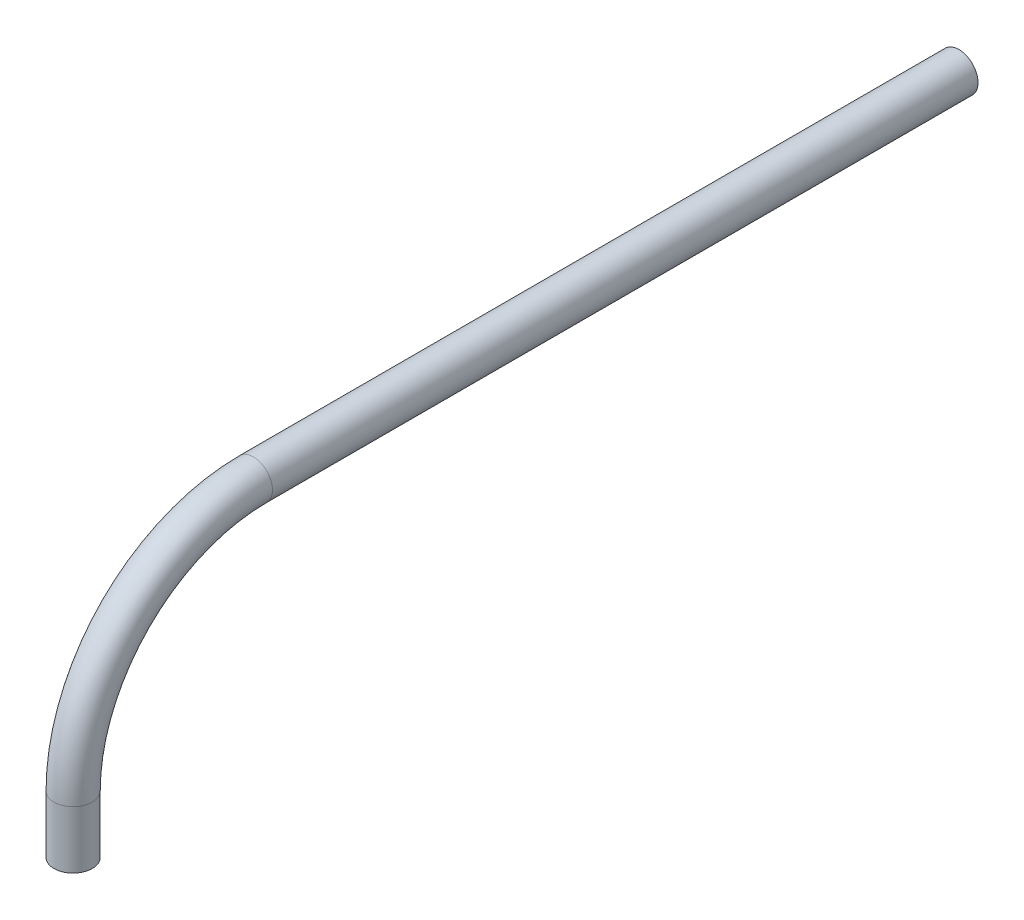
from build123d import *

# Parameters (mm, degrees)
SKETCH1_R     = 7.9375
SKETCH1_R_2   = 6.2865
CHAMFER1_SIZE = 0.508


with BuildPart() as part:
    # Sweep1: sweep along a path in Sketch2
    with BuildLine(Plane(origin=(0, 0, 0), x_dir=(0, 0, -1), z_dir=(1, 0, 0))) as sweep1_path:
        Line((0, 0), (-292.1, 0))
        ThreePointArc((-292.1, 0), (-344.859004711, -21.853495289), (-366.7125, -74.6125))
        Line((-366.7125, -74.6125), (-366.7125, -98.425))
    # Sketch1 → Sweep1 (sweep)
    with BuildSketch(Plane.XY):
        Circle(SKETCH1_R)
        Circle(SKETCH1_R_2, mode=Mode.SUBTRACT)
    sweep(path=sweep1_path.line)

    # Chamfer1
    chamfer1_edges = [part.edges().sort_by_distance(p)[0] for p in [
        (-6.2865, 0, 0),
    ]]
    chamfer(chamfer1_edges, length=CHAMFER1_SIZE)


solid = part.part
